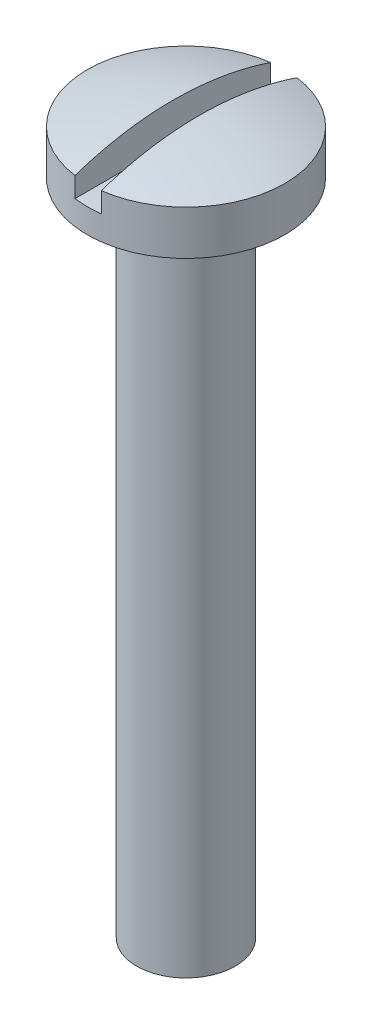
from build123d import *

# Parameters (mm, degrees)
ENL_V_MAT_EXTRU_1_DEPTH      = 45.516176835
ENL_V_MAT_EXTRU_1_DEPTH_BACK = 45.516176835


with BuildPart() as part:
    # Esquisse1 → R_volution1 (revolve)
    with BuildSketch(Plane.XY, mode=Mode.PRIVATE) as r_volution1_sk:
        with BuildLine():
            Line((0, 0), (0, 43.7))
            ThreePointArc((0, 43.7), (3.041381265, 43.448287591), (6, 42.7))
            Line((6, 42.7), (6, 40))
            Line((6, 40), (3, 40))
            Line((3, 40), (3, 0))
            Line((3, 0), (0, 0))
        make_face()
    revolve(r_volution1_sk.sketch.rotate(Axis((0, 0, 0), (0, 1, 0)), 90), axis=Axis((0, 0, 0), (0, 1, 0)))

    # Esquisse2 → Enl_v. mat.-Extru.1 (cut, two sides: drawn at the far end of the back side and taken through both)
    with BuildSketch(Plane.XY.offset(-ENL_V_MAT_EXTRU_1_DEPTH_BACK)):
        with BuildLine():
            Line((-0.8, 43.682694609), (-0.8, 41.482694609))
            Line((-0.8, 41.482694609), (0.8, 41.482694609))
            Line((0.8, 41.482694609), (0.8, 43.682694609))
            ThreePointArc((0.8, 43.682694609), (0, 43.7), (-0.8, 43.682694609))
        make_face()
    extrude(amount=ENL_V_MAT_EXTRU_1_DEPTH + ENL_V_MAT_EXTRU_1_DEPTH_BACK, mode=Mode.SUBTRACT)


solid = part.part
